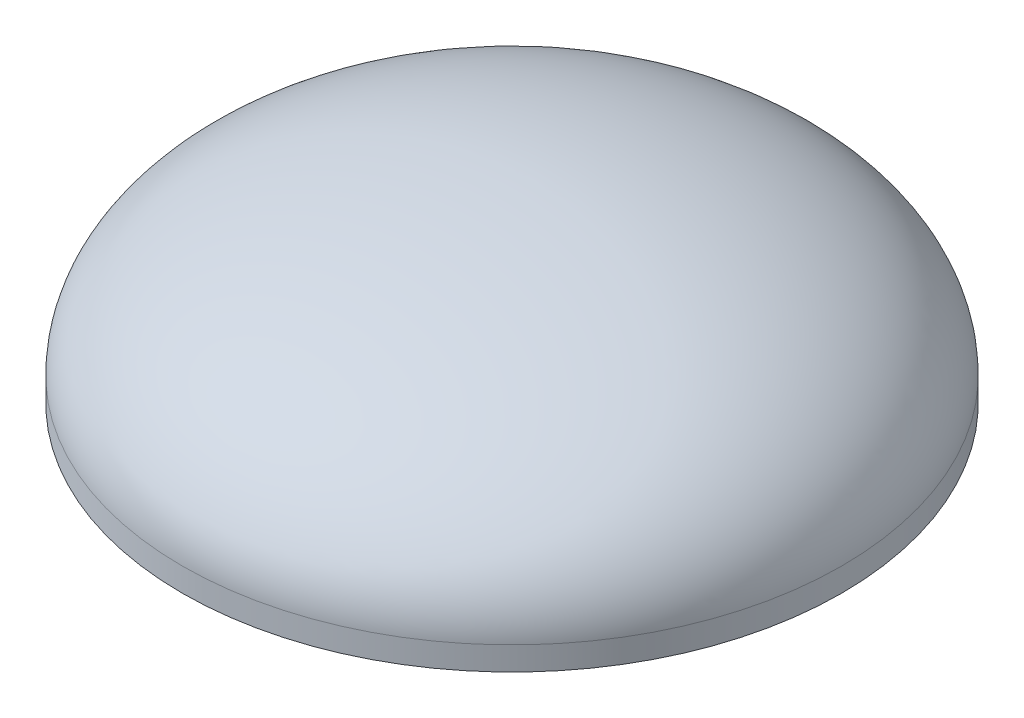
from build123d import *

# Parameters (mm, degrees)
SHELL1_T = -12.7


with BuildPart() as part:
    # Sketch1 → Revolve1 (revolve)
    with BuildSketch(Plane.XY, mode=Mode.PRIVATE) as revolve1_sk:
        with BuildLine():
            Line((711.2, 0), (711.2, -50.8))
            Line((711.2, -50.8), (0, -50.8))
            Line((0, -50.8), (0, 355.6))
            add(Edge.make_bspline(
                [(711.2, 0), (711.2, 355.6), (0, 355.6)],
                knots=[3.141592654, 3.141592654, 3.141592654, 4.71238898, 4.71238898, 4.71238898], degree=2, weights=[1, 0.707106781, 1]))
        make_face()
    revolve(revolve1_sk.sketch.rotate(Axis((0, 441.323897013, 0), (0, -1, 0)), 180), axis=Axis((0, 441.323897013, 0), (0, -1, 0)))

    # Shell1
    shell1_openings = [part.faces().sort_by_distance(p)[0] for p in [
        (0, -50.8, 0),
    ]]
    offset(amount=SHELL1_T, openings=shell1_openings, kind=Kind.INTERSECTION)


solid = part.part
